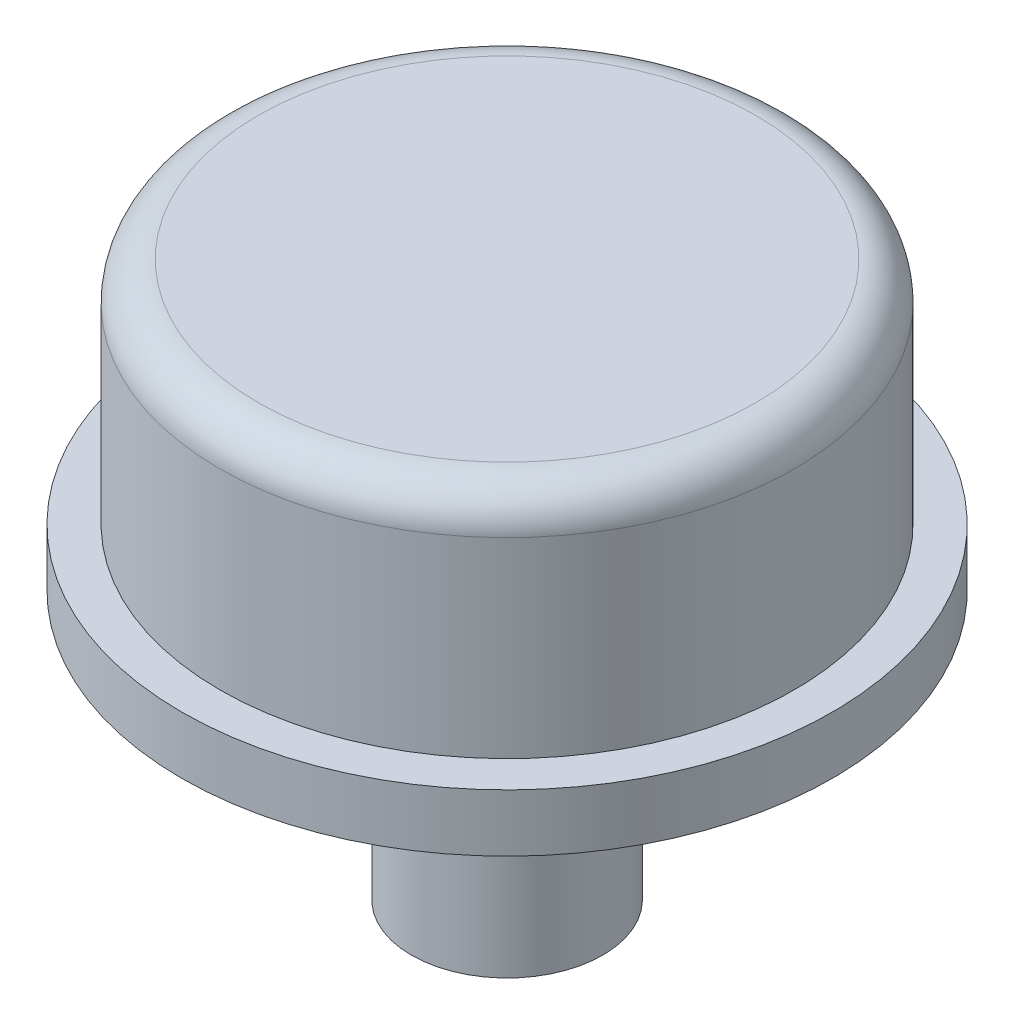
ISO-10303-21;
HEADER;
FILE_DESCRIPTION(('STEP AP214'),'2;1');
FILE_NAME('part.step','',(''),(''),'','','');
FILE_SCHEMA(('AUTOMOTIVE_DESIGN { 1 0 10303 214 1 1 1 1 }'));
ENDSEC;
DATA;
#1=APPLICATION_CONTEXT('core data for automotive mechanical design processes');
#2=APPLICATION_PROTOCOL_DEFINITION('international standard','automotive_design',2000,#1);
#3=PRODUCT_CONTEXT('',#1,'mechanical');
#4=PRODUCT('Part','Part','',(#3));
#5=PRODUCT_RELATED_PRODUCT_CATEGORY('part','',(#4));
#6=PRODUCT_DEFINITION_FORMATION('','',#4);
#7=PRODUCT_DEFINITION_CONTEXT('part definition',#1,'design');
#8=PRODUCT_DEFINITION('design','',#6,#7);
#9=PRODUCT_DEFINITION_SHAPE('','',#8);
#10=(LENGTH_UNIT() NAMED_UNIT(*) SI_UNIT(.MILLI.,.METRE.));
#11=(NAMED_UNIT(*) PLANE_ANGLE_UNIT() SI_UNIT($,.RADIAN.));
#12=(NAMED_UNIT(*) SI_UNIT($,.STERADIAN.) SOLID_ANGLE_UNIT());
#13=UNCERTAINTY_MEASURE_WITH_UNIT(LENGTH_MEASURE(1.E-05),#10,'distance_accuracy_value','');
#14=(GEOMETRIC_REPRESENTATION_CONTEXT(3) GLOBAL_UNCERTAINTY_ASSIGNED_CONTEXT((#13)) GLOBAL_UNIT_ASSIGNED_CONTEXT((#10,
#11,#12)) REPRESENTATION_CONTEXT('',''));
#15=CARTESIAN_POINT('',(0.,0.,0.));
#16=DIRECTION('',(0.,0.,1.));
#17=DIRECTION('',(1.,0.,0.));
#18=AXIS2_PLACEMENT_3D('',#15,#16,#17);
#19=CARTESIAN_POINT('',(0.,63.3818104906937,0.));
#20=DIRECTION('',(0.,1.,0.));
#21=DIRECTION('',(0.,0.,1.));
#22=AXIS2_PLACEMENT_3D('',#19,#20,#21);
#23=CYLINDRICAL_SURFACE('',#22,8.49999999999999);
#24=CARTESIAN_POINT('',(0.,-1.5,0.));
#25=DIRECTION('',(0.,1.,0.));
#26=DIRECTION('',(0.,0.,1.));
#27=AXIS2_PLACEMENT_3D('',#24,#25,#26);
#28=CIRCLE('',#27,8.49999999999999);
#29=CARTESIAN_POINT('',(0.,-1.5,8.49999999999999));
#30=VERTEX_POINT('',#29);
#31=EDGE_CURVE('E44',#30,#30,#28,.T.);
#32=ORIENTED_EDGE('',*,*,#31,.T.);
#33=EDGE_LOOP('',(#32));
#34=FACE_BOUND('',#33,.T.);
#35=CARTESIAN_POINT('',(0.,0.,0.));
#36=DIRECTION('',(0.,1.,0.));
#37=DIRECTION('',(0.,0.,1.));
#38=AXIS2_PLACEMENT_3D('',#35,#36,#37);
#39=CIRCLE('',#38,8.49999999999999);
#40=CARTESIAN_POINT('',(0.,0.,8.49999999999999));
#41=VERTEX_POINT('',#40);
#42=EDGE_CURVE('E59',#41,#41,#39,.T.);
#43=ORIENTED_EDGE('',*,*,#42,.F.);
#44=EDGE_LOOP('',(#43));
#45=FACE_BOUND('',#44,.T.);
#46=ADVANCED_FACE('F33',(#34,#45),#23,.T.);
#47=CARTESIAN_POINT('',(-8.49999999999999,-1.5,0.));
#48=DIRECTION('',(0.,-1.,0.));
#49=DIRECTION('',(0.,0.,-1.));
#50=AXIS2_PLACEMENT_3D('',#47,#48,#49);
#51=PLANE('',#50);
#52=CARTESIAN_POINT('',(0.,-1.5,0.));
#53=DIRECTION('',(0.,1.,0.));
#54=DIRECTION('',(0.,0.,1.));
#55=AXIS2_PLACEMENT_3D('',#52,#53,#54);
#56=CIRCLE('',#55,2.49999999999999);
#57=CARTESIAN_POINT('',(0.,-1.5,2.49999999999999));
#58=VERTEX_POINT('',#57);
#59=EDGE_CURVE('E48',#58,#58,#56,.T.);
#60=ORIENTED_EDGE('',*,*,#59,.T.);
#61=EDGE_LOOP('',(#60));
#62=FACE_BOUND('',#61,.T.);
#63=ORIENTED_EDGE('',*,*,#31,.F.);
#64=EDGE_LOOP('',(#63));
#65=FACE_BOUND('',#64,.T.);
#66=ADVANCED_FACE('F67',(#62,#65),#51,.T.);
#67=CARTESIAN_POINT('',(0.,63.3818104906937,0.));
#68=DIRECTION('',(0.,1.,0.));
#69=DIRECTION('',(0.,0.,1.));
#70=AXIS2_PLACEMENT_3D('',#67,#68,#69);
#71=CYLINDRICAL_SURFACE('',#70,2.49999999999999);
#72=CARTESIAN_POINT('',(0.,-8.50000000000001,0.));
#73=DIRECTION('',(0.,1.,0.));
#74=DIRECTION('',(0.,0.,1.));
#75=AXIS2_PLACEMENT_3D('',#72,#73,#74);
#76=CIRCLE('',#75,2.49999999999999);
#77=CARTESIAN_POINT('',(0.,-8.50000000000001,2.49999999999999));
#78=VERTEX_POINT('',#77);
#79=EDGE_CURVE('E53',#78,#78,#76,.T.);
#80=ORIENTED_EDGE('',*,*,#79,.T.);
#81=EDGE_LOOP('',(#80));
#82=FACE_BOUND('',#81,.T.);
#83=ORIENTED_EDGE('',*,*,#59,.F.);
#84=EDGE_LOOP('',(#83));
#85=FACE_BOUND('',#84,.T.);
#86=ADVANCED_FACE('F72',(#82,#85),#71,.T.);
#87=CARTESIAN_POINT('',(-2.49999999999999,-8.5,0.));
#88=DIRECTION('',(0.,-1.,0.));
#89=DIRECTION('',(0.,0.,-1.));
#90=AXIS2_PLACEMENT_3D('',#87,#88,#89);
#91=PLANE('',#90);
#92=ORIENTED_EDGE('',*,*,#79,.F.);
#93=EDGE_LOOP('',(#92));
#94=FACE_BOUND('',#93,.T.);
#95=ADVANCED_FACE('F78',(#94),#91,.T.);
#96=CARTESIAN_POINT('',(-7.49999999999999,6.,0.));
#97=DIRECTION('',(0.,1.,0.));
#98=DIRECTION('',(0.,0.,1.));
#99=AXIS2_PLACEMENT_3D('',#96,#97,#98);
#100=PLANE('',#99);
#101=CARTESIAN_POINT('',(0.,6.,0.));
#102=DIRECTION('',(0.,1.,0.));
#103=DIRECTION('',(0.,0.,1.));
#104=AXIS2_PLACEMENT_3D('',#101,#102,#103);
#105=CIRCLE('',#104,6.49999999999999);
#106=CARTESIAN_POINT('',(0.,6.,6.49999999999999));
#107=VERTEX_POINT('',#106);
#108=EDGE_CURVE('E40',#107,#107,#105,.T.);
#109=ORIENTED_EDGE('',*,*,#108,.T.);
#110=EDGE_LOOP('',(#109));
#111=FACE_BOUND('',#110,.T.);
#112=ADVANCED_FACE('F82',(#111),#100,.T.);
#113=CARTESIAN_POINT('',(0.,63.3818104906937,0.));
#114=DIRECTION('',(0.,1.,0.));
#115=DIRECTION('',(0.,0.,1.));
#116=AXIS2_PLACEMENT_3D('',#113,#114,#115);
#117=CYLINDRICAL_SURFACE('',#116,7.49999999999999);
#118=CARTESIAN_POINT('',(0.,5.,0.));
#119=DIRECTION('',(0.,1.,0.));
#120=DIRECTION('',(0.,0.,1.));
#121=AXIS2_PLACEMENT_3D('',#118,#119,#120);
#122=CIRCLE('',#121,7.49999999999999);
#123=CARTESIAN_POINT('',(0.,5.,7.49999999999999));
#124=VERTEX_POINT('',#123);
#125=EDGE_CURVE('E10',#124,#124,#122,.F.);
#126=ORIENTED_EDGE('',*,*,#125,.T.);
#127=EDGE_LOOP('',(#126));
#128=FACE_BOUND('',#127,.T.);
#129=CARTESIAN_POINT('',(0.,0.,0.));
#130=DIRECTION('',(0.,1.,0.));
#131=DIRECTION('',(0.,0.,1.));
#132=AXIS2_PLACEMENT_3D('',#129,#130,#131);
#133=CIRCLE('',#132,7.49999999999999);
#134=CARTESIAN_POINT('',(0.,0.,7.49999999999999));
#135=VERTEX_POINT('',#134);
#136=EDGE_CURVE('E56',#135,#135,#133,.T.);
#137=ORIENTED_EDGE('',*,*,#136,.T.);
#138=EDGE_LOOP('',(#137));
#139=FACE_BOUND('',#138,.T.);
#140=ADVANCED_FACE('F86',(#128,#139),#117,.T.);
#141=CARTESIAN_POINT('',(-7.49999999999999,0.,0.));
#142=DIRECTION('',(0.,1.,0.));
#143=DIRECTION('',(0.,0.,1.));
#144=AXIS2_PLACEMENT_3D('',#141,#142,#143);
#145=PLANE('',#144);
#146=ORIENTED_EDGE('',*,*,#42,.T.);
#147=EDGE_LOOP('',(#146));
#148=FACE_BOUND('',#147,.T.);
#149=ORIENTED_EDGE('',*,*,#136,.F.);
#150=EDGE_LOOP('',(#149));
#151=FACE_BOUND('',#150,.T.);
#152=ADVANCED_FACE('F63',(#148,#151),#145,.T.);
#153=CARTESIAN_POINT('',(0.,5.,0.));
#154=DIRECTION('',(0.,1.,0.));
#155=DIRECTION('',(0.,0.,1.));
#156=AXIS2_PLACEMENT_3D('',#153,#154,#155);
#157=TOROIDAL_SURFACE('',#156,6.49999999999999,1.);
#158=ORIENTED_EDGE('',*,*,#125,.F.);
#159=EDGE_LOOP('',(#158));
#160=FACE_BOUND('',#159,.T.);
#161=ORIENTED_EDGE('',*,*,#108,.F.);
#162=EDGE_LOOP('',(#161));
#163=FACE_BOUND('',#162,.T.);
#164=ADVANCED_FACE('F35',(#160,#163),#157,.T.);
#165=CLOSED_SHELL('',(#46,#66,#86,#95,#112,#140,#152,#164));
#166=MANIFOLD_SOLID_BREP('B2',#165);
#167=ADVANCED_BREP_SHAPE_REPRESENTATION('',(#18,#166),#14);
#168=SHAPE_DEFINITION_REPRESENTATION(#9,#167);
ENDSEC;
END-ISO-10303-21;
